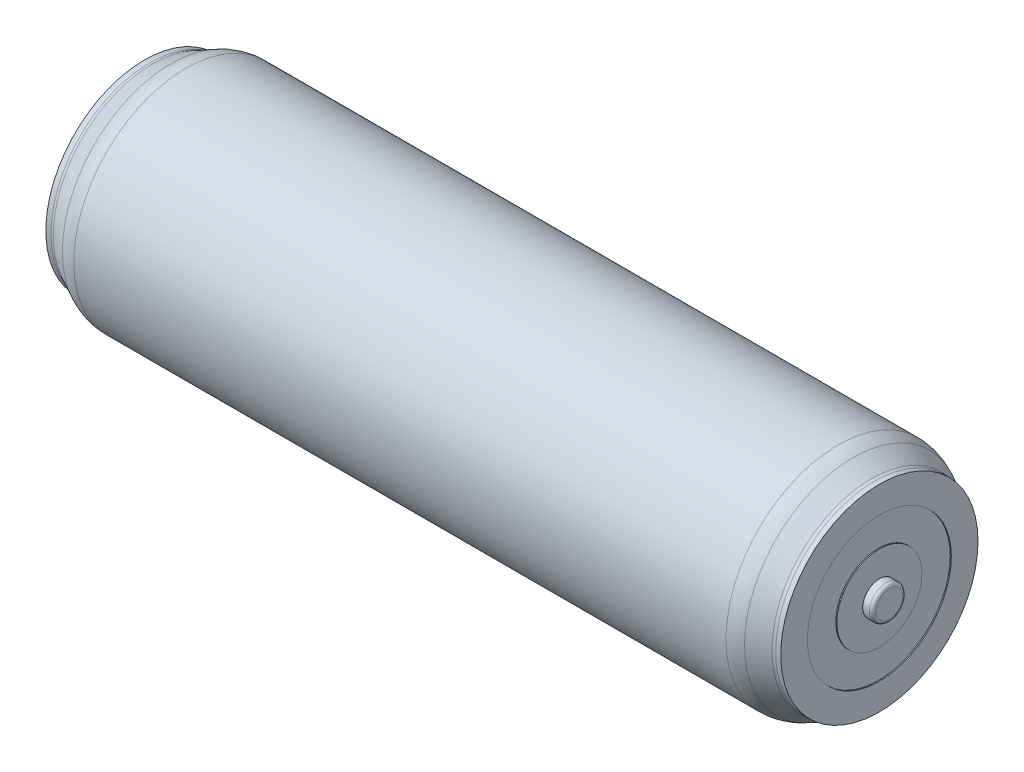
ISO-10303-21;
HEADER;
FILE_DESCRIPTION(('STEP AP214'),'2;1');
FILE_NAME('part.step','',(''),(''),'','','');
FILE_SCHEMA(('AUTOMOTIVE_DESIGN { 1 0 10303 214 1 1 1 1 }'));
ENDSEC;
DATA;
#1=APPLICATION_CONTEXT('core data for automotive mechanical design processes');
#2=APPLICATION_PROTOCOL_DEFINITION('international standard','automotive_design',2000,#1);
#3=PRODUCT_CONTEXT('',#1,'mechanical');
#4=PRODUCT('Part','Part','',(#3));
#5=PRODUCT_RELATED_PRODUCT_CATEGORY('part','',(#4));
#6=PRODUCT_DEFINITION_FORMATION('','',#4);
#7=PRODUCT_DEFINITION_CONTEXT('part definition',#1,'design');
#8=PRODUCT_DEFINITION('design','',#6,#7);
#9=PRODUCT_DEFINITION_SHAPE('','',#8);
#10=(LENGTH_UNIT() NAMED_UNIT(*) SI_UNIT(.MILLI.,.METRE.));
#11=(NAMED_UNIT(*) PLANE_ANGLE_UNIT() SI_UNIT($,.RADIAN.));
#12=(NAMED_UNIT(*) SI_UNIT($,.STERADIAN.) SOLID_ANGLE_UNIT());
#13=UNCERTAINTY_MEASURE_WITH_UNIT(LENGTH_MEASURE(1.E-05),#10,'distance_accuracy_value','');
#14=(GEOMETRIC_REPRESENTATION_CONTEXT(3) GLOBAL_UNCERTAINTY_ASSIGNED_CONTEXT((#13)) GLOBAL_UNIT_ASSIGNED_CONTEXT((#10,
#11,#12)) REPRESENTATION_CONTEXT('',''));
#15=CARTESIAN_POINT('',(0.,0.,0.));
#16=DIRECTION('',(0.,0.,1.));
#17=DIRECTION('',(1.,0.,0.));
#18=AXIS2_PLACEMENT_3D('',#15,#16,#17);
#19=CARTESIAN_POINT('',(0.,0.,0.));
#20=DIRECTION('',(-1.,0.,0.));
#21=DIRECTION('',(0.,0.,1.));
#22=AXIS2_PLACEMENT_3D('',#19,#20,#21);
#23=PLANE('',#22);
#24=CARTESIAN_POINT('',(0.,0.,0.));
#25=DIRECTION('',(1.,0.,0.));
#26=DIRECTION('',(0.,0.,-1.));
#27=AXIS2_PLACEMENT_3D('',#24,#25,#26);
#28=CIRCLE('',#27,2.5);
#29=CARTESIAN_POINT('',(0.,0.,-2.5));
#30=VERTEX_POINT('',#29);
#31=EDGE_CURVE('E113',#30,#30,#28,.T.);
#32=ORIENTED_EDGE('',*,*,#31,.F.);
#33=EDGE_LOOP('',(#32));
#34=FACE_BOUND('',#33,.T.);
#35=ADVANCED_FACE('F34',(#34),#23,.T.);
#36=CARTESIAN_POINT('',(111.4,0.,0.));
#37=DIRECTION('',(1.,0.,0.));
#38=DIRECTION('',(0.,0.,-1.));
#39=AXIS2_PLACEMENT_3D('',#36,#37,#38);
#40=PLANE('',#39);
#41=CARTESIAN_POINT('',(111.4,0.,0.));
#42=DIRECTION('',(1.,0.,0.));
#43=DIRECTION('',(0.,0.,-1.));
#44=AXIS2_PLACEMENT_3D('',#41,#42,#43);
#45=CIRCLE('',#44,2.);
#46=CARTESIAN_POINT('',(111.4,0.,-2.));
#47=VERTEX_POINT('',#46);
#48=EDGE_CURVE('E10',#47,#47,#45,.T.);
#49=ORIENTED_EDGE('',*,*,#48,.T.);
#50=EDGE_LOOP('',(#49));
#51=FACE_BOUND('',#50,.T.);
#52=ADVANCED_FACE('F121',(#51),#40,.T.);
#53=CARTESIAN_POINT('',(110.9,0.,0.));
#54=DIRECTION('',(1.,0.,0.));
#55=DIRECTION('',(0.,0.,-1.));
#56=AXIS2_PLACEMENT_3D('',#53,#54,#55);
#57=TOROIDAL_SURFACE('',#56,2.,0.5);
#58=CARTESIAN_POINT('',(110.9,0.,0.));
#59=DIRECTION('',(1.,0.,0.));
#60=DIRECTION('',(0.,0.,-1.));
#61=AXIS2_PLACEMENT_3D('',#58,#59,#60);
#62=CIRCLE('',#61,2.5);
#63=CARTESIAN_POINT('',(110.9,0.,-2.5));
#64=VERTEX_POINT('',#63);
#65=EDGE_CURVE('E40',#64,#64,#62,.T.);
#66=ORIENTED_EDGE('',*,*,#65,.T.);
#67=EDGE_LOOP('',(#66));
#68=FACE_BOUND('',#67,.T.);
#69=ORIENTED_EDGE('',*,*,#48,.F.);
#70=EDGE_LOOP('',(#69));
#71=FACE_BOUND('',#70,.T.);
#72=ADVANCED_FACE('F125',(#68,#71),#57,.T.);
#73=CARTESIAN_POINT('',(124.515909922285,0.,0.));
#74=DIRECTION('',(1.,0.,0.));
#75=DIRECTION('',(0.,0.,-1.));
#76=AXIS2_PLACEMENT_3D('',#73,#74,#75);
#77=CYLINDRICAL_SURFACE('',#76,2.5);
#78=CARTESIAN_POINT('',(109.9,0.,0.));
#79=DIRECTION('',(1.,0.,0.));
#80=DIRECTION('',(0.,0.,-1.));
#81=AXIS2_PLACEMENT_3D('',#78,#79,#80);
#82=CIRCLE('',#81,2.5);
#83=CARTESIAN_POINT('',(109.9,0.,-2.5));
#84=VERTEX_POINT('',#83);
#85=EDGE_CURVE('E44',#84,#84,#82,.T.);
#86=ORIENTED_EDGE('',*,*,#85,.T.);
#87=EDGE_LOOP('',(#86));
#88=FACE_BOUND('',#87,.T.);
#89=ORIENTED_EDGE('',*,*,#65,.F.);
#90=EDGE_LOOP('',(#89));
#91=FACE_BOUND('',#90,.T.);
#92=ADVANCED_FACE('F129',(#88,#91),#77,.T.);
#93=CARTESIAN_POINT('',(109.9,-2.5,0.));
#94=DIRECTION('',(1.,0.,0.));
#95=DIRECTION('',(0.,0.,-1.));
#96=AXIS2_PLACEMENT_3D('',#93,#94,#95);
#97=PLANE('',#96);
#98=CARTESIAN_POINT('',(109.9,0.,0.));
#99=DIRECTION('',(1.,0.,0.));
#100=DIRECTION('',(0.,0.,-1.));
#101=AXIS2_PLACEMENT_3D('',#98,#99,#100);
#102=CIRCLE('',#101,6.35759511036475);
#103=CARTESIAN_POINT('',(109.9,0.,-6.35759511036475));
#104=VERTEX_POINT('',#103);
#105=EDGE_CURVE('E48',#104,#104,#102,.T.);
#106=ORIENTED_EDGE('',*,*,#105,.T.);
#107=EDGE_LOOP('',(#106));
#108=FACE_BOUND('',#107,.T.);
#109=ORIENTED_EDGE('',*,*,#85,.F.);
#110=EDGE_LOOP('',(#109));
#111=FACE_BOUND('',#110,.T.);
#112=ADVANCED_FACE('F134',(#108,#111),#97,.T.);
#113=CARTESIAN_POINT('',(124.515909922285,0.,0.));
#114=DIRECTION('',(1.,0.,0.));
#115=DIRECTION('',(0.,0.,-1.));
#116=AXIS2_PLACEMENT_3D('',#113,#114,#115);
#117=CYLINDRICAL_SURFACE('',#116,6.35759511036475);
#118=CARTESIAN_POINT('',(109.746341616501,0.,0.));
#119=DIRECTION('',(1.,0.,0.));
#120=DIRECTION('',(0.,0.,-1.));
#121=AXIS2_PLACEMENT_3D('',#118,#119,#120);
#122=CIRCLE('',#121,6.35759511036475);
#123=CARTESIAN_POINT('',(109.746341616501,0.,-6.35759511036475));
#124=VERTEX_POINT('',#123);
#125=EDGE_CURVE('E53',#124,#124,#122,.T.);
#126=ORIENTED_EDGE('',*,*,#125,.T.);
#127=EDGE_LOOP('',(#126));
#128=FACE_BOUND('',#127,.T.);
#129=ORIENTED_EDGE('',*,*,#105,.F.);
#130=EDGE_LOOP('',(#129));
#131=FACE_BOUND('',#130,.T.);
#132=ADVANCED_FACE('F138',(#128,#131),#117,.T.);
#133=CARTESIAN_POINT('',(109.746341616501,-10.760927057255,0.));
#134=DIRECTION('',(1.,0.,0.));
#135=DIRECTION('',(0.,0.,-1.));
#136=AXIS2_PLACEMENT_3D('',#133,#134,#135);
#137=PLANE('',#136);
#138=CARTESIAN_POINT('',(109.746341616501,0.,0.));
#139=DIRECTION('',(1.,0.,0.));
#140=DIRECTION('',(0.,0.,-1.));
#141=AXIS2_PLACEMENT_3D('',#138,#139,#140);
#142=CIRCLE('',#141,10.760927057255);
#143=CARTESIAN_POINT('',(109.746341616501,0.,-10.760927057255));
#144=VERTEX_POINT('',#143);
#145=EDGE_CURVE('E56',#144,#144,#142,.T.);
#146=ORIENTED_EDGE('',*,*,#145,.T.);
#147=EDGE_LOOP('',(#146));
#148=FACE_BOUND('',#147,.T.);
#149=ORIENTED_EDGE('',*,*,#125,.F.);
#150=EDGE_LOOP('',(#149));
#151=FACE_BOUND('',#150,.T.);
#152=ADVANCED_FACE('F142',(#148,#151),#137,.T.);
#153=CARTESIAN_POINT('',(124.515909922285,0.,0.));
#154=DIRECTION('',(1.,0.,0.));
#155=DIRECTION('',(0.,0.,-1.));
#156=AXIS2_PLACEMENT_3D('',#153,#154,#155);
#157=CYLINDRICAL_SURFACE('',#156,10.760927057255);
#158=CARTESIAN_POINT('',(109.9,0.,0.));
#159=DIRECTION('',(1.,0.,0.));
#160=DIRECTION('',(0.,0.,-1.));
#161=AXIS2_PLACEMENT_3D('',#158,#159,#160);
#162=CIRCLE('',#161,10.760927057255);
#163=CARTESIAN_POINT('',(109.9,0.,-10.760927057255));
#164=VERTEX_POINT('',#163);
#165=EDGE_CURVE('E59',#164,#164,#162,.T.);
#166=ORIENTED_EDGE('',*,*,#165,.T.);
#167=EDGE_LOOP('',(#166));
#168=FACE_BOUND('',#167,.T.);
#169=ORIENTED_EDGE('',*,*,#145,.F.);
#170=EDGE_LOOP('',(#169));
#171=FACE_BOUND('',#170,.T.);
#172=ADVANCED_FACE('F146',(#168,#171),#157,.F.);
#173=CARTESIAN_POINT('',(109.9,-10.760927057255,0.));
#174=DIRECTION('',(1.,0.,0.));
#175=DIRECTION('',(0.,0.,-1.));
#176=AXIS2_PLACEMENT_3D('',#173,#174,#175);
#177=PLANE('',#176);
#178=CARTESIAN_POINT('',(109.9,0.,0.));
#179=DIRECTION('',(1.,0.,0.));
#180=DIRECTION('',(0.,0.,-1.));
#181=AXIS2_PLACEMENT_3D('',#178,#179,#180);
#182=CIRCLE('',#181,14.75);
#183=CARTESIAN_POINT('',(109.9,0.,-14.75));
#184=VERTEX_POINT('',#183);
#185=EDGE_CURVE('E62',#184,#184,#182,.T.);
#186=ORIENTED_EDGE('',*,*,#185,.T.);
#187=EDGE_LOOP('',(#186));
#188=FACE_BOUND('',#187,.T.);
#189=ORIENTED_EDGE('',*,*,#165,.F.);
#190=EDGE_LOOP('',(#189));
#191=FACE_BOUND('',#190,.T.);
#192=ADVANCED_FACE('F150',(#188,#191),#177,.T.);
#193=CARTESIAN_POINT('',(124.515909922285,0.,0.));
#194=DIRECTION('',(1.,0.,0.));
#195=DIRECTION('',(0.,0.,-1.));
#196=AXIS2_PLACEMENT_3D('',#193,#194,#195);
#197=CYLINDRICAL_SURFACE('',#196,14.75);
#198=CARTESIAN_POINT('',(109.1360679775,0.,0.));
#199=DIRECTION('',(1.,0.,0.));
#200=DIRECTION('',(0.,0.,-1.));
#201=AXIS2_PLACEMENT_3D('',#198,#199,#200);
#202=CIRCLE('',#201,14.75);
#203=CARTESIAN_POINT('',(109.1360679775,0.,-14.75));
#204=VERTEX_POINT('',#203);
#205=EDGE_CURVE('E65',#204,#204,#202,.T.);
#206=ORIENTED_EDGE('',*,*,#205,.T.);
#207=EDGE_LOOP('',(#206));
#208=FACE_BOUND('',#207,.T.);
#209=ORIENTED_EDGE('',*,*,#185,.F.);
#210=EDGE_LOOP('',(#209));
#211=FACE_BOUND('',#210,.T.);
#212=ADVANCED_FACE('F154',(#208,#211),#197,.T.);
#213=CARTESIAN_POINT('',(109.1360679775,0.,0.));
#214=DIRECTION('',(1.,0.,0.));
#215=DIRECTION('',(0.,0.,-1.));
#216=AXIS2_PLACEMENT_3D('',#213,#214,#215);
#217=TOROIDAL_SURFACE('',#216,15.75,1.);
#218=CARTESIAN_POINT('',(108.688854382,0.,0.));
#219=DIRECTION('',(1.,0.,0.));
#220=DIRECTION('',(0.,0.,-1.));
#221=AXIS2_PLACEMENT_3D('',#218,#219,#220);
#222=CIRCLE('',#221,14.8555728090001);
#223=CARTESIAN_POINT('',(108.688854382,0.,-14.8555728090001));
#224=VERTEX_POINT('',#223);
#225=EDGE_CURVE('E68',#224,#224,#222,.T.);
#226=ORIENTED_EDGE('',*,*,#225,.T.);
#227=EDGE_LOOP('',(#226));
#228=FACE_BOUND('',#227,.T.);
#229=ORIENTED_EDGE('',*,*,#205,.F.);
#230=EDGE_LOOP('',(#229));
#231=FACE_BOUND('',#230,.T.);
#232=ADVANCED_FACE('F158',(#228,#231),#217,.F.);
#233=CARTESIAN_POINT('',(108.688854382,0.,0.));
#234=DIRECTION('',(-1.,0.,0.));
#235=DIRECTION('',(0.,0.,1.));
#236=AXIS2_PLACEMENT_3D('',#233,#234,#235);
#237=CONICAL_SURFACE('',#236,14.8555728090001,0.463647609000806);
#238=CARTESIAN_POINT('',(105.955728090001,0.,0.));
#239=DIRECTION('',(1.,0.,0.));
#240=DIRECTION('',(0.,0.,-1.));
#241=AXIS2_PLACEMENT_3D('',#238,#239,#240);
#242=CIRCLE('',#241,16.2221359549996);
#243=CARTESIAN_POINT('',(105.955728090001,0.,-16.2221359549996));
#244=VERTEX_POINT('',#243);
#245=EDGE_CURVE('E71',#244,#244,#242,.T.);
#246=ORIENTED_EDGE('',*,*,#245,.T.);
#247=EDGE_LOOP('',(#246));
#248=FACE_BOUND('',#247,.T.);
#249=ORIENTED_EDGE('',*,*,#225,.F.);
#250=EDGE_LOOP('',(#249));
#251=FACE_BOUND('',#250,.T.);
#252=ADVANCED_FACE('F162',(#248,#251),#237,.T.);
#253=CARTESIAN_POINT('',(103.719660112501,0.,0.));
#254=DIRECTION('',(1.,0.,0.));
#255=DIRECTION('',(0.,0.,-1.));
#256=AXIS2_PLACEMENT_3D('',#253,#254,#255);
#257=TOROIDAL_SURFACE('',#256,11.75,5.);
#258=CARTESIAN_POINT('',(103.719660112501,0.,0.));
#259=DIRECTION('',(1.,0.,0.));
#260=DIRECTION('',(0.,0.,-1.));
#261=AXIS2_PLACEMENT_3D('',#258,#259,#260);
#262=CIRCLE('',#261,16.75);
#263=CARTESIAN_POINT('',(103.719660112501,0.,-16.75));
#264=VERTEX_POINT('',#263);
#265=EDGE_CURVE('E74',#264,#264,#262,.T.);
#266=ORIENTED_EDGE('',*,*,#265,.T.);
#267=EDGE_LOOP('',(#266));
#268=FACE_BOUND('',#267,.T.);
#269=ORIENTED_EDGE('',*,*,#245,.F.);
#270=EDGE_LOOP('',(#269));
#271=FACE_BOUND('',#270,.T.);
#272=ADVANCED_FACE('F166',(#268,#271),#257,.T.);
#273=CARTESIAN_POINT('',(124.515909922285,0.,0.));
#274=DIRECTION('',(1.,0.,0.));
#275=DIRECTION('',(0.,0.,-1.));
#276=AXIS2_PLACEMENT_3D('',#273,#274,#275);
#277=CYLINDRICAL_SURFACE('',#276,16.75);
#278=CARTESIAN_POINT('',(6.18033988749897,0.,0.));
#279=DIRECTION('',(1.,0.,0.));
#280=DIRECTION('',(0.,0.,-1.));
#281=AXIS2_PLACEMENT_3D('',#278,#279,#280);
#282=CIRCLE('',#281,16.75);
#283=CARTESIAN_POINT('',(6.18033988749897,0.,-16.75));
#284=VERTEX_POINT('',#283);
#285=EDGE_CURVE('E77',#284,#284,#282,.T.);
#286=ORIENTED_EDGE('',*,*,#285,.T.);
#287=EDGE_LOOP('',(#286));
#288=FACE_BOUND('',#287,.T.);
#289=ORIENTED_EDGE('',*,*,#265,.F.);
#290=EDGE_LOOP('',(#289));
#291=FACE_BOUND('',#290,.T.);
#292=ADVANCED_FACE('F170',(#288,#291),#277,.T.);
#293=CARTESIAN_POINT('',(6.18033988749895,0.,0.));
#294=DIRECTION('',(1.,0.,0.));
#295=DIRECTION('',(0.,0.,-1.));
#296=AXIS2_PLACEMENT_3D('',#293,#294,#295);
#297=TOROIDAL_SURFACE('',#296,11.75,5.);
#298=CARTESIAN_POINT('',(3.94427190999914,0.,0.));
#299=DIRECTION('',(1.,0.,0.));
#300=DIRECTION('',(0.,0.,-1.));
#301=AXIS2_PLACEMENT_3D('',#298,#299,#300);
#302=CIRCLE('',#301,16.2221359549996);
#303=CARTESIAN_POINT('',(3.94427190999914,0.,-16.2221359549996));
#304=VERTEX_POINT('',#303);
#305=EDGE_CURVE('E80',#304,#304,#302,.T.);
#306=ORIENTED_EDGE('',*,*,#305,.T.);
#307=EDGE_LOOP('',(#306));
#308=FACE_BOUND('',#307,.T.);
#309=ORIENTED_EDGE('',*,*,#285,.F.);
#310=EDGE_LOOP('',(#309));
#311=FACE_BOUND('',#310,.T.);
#312=ADVANCED_FACE('F174',(#308,#311),#297,.T.);
#313=CARTESIAN_POINT('',(3.94427190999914,0.,0.));
#314=DIRECTION('',(1.,0.,0.));
#315=DIRECTION('',(0.,0.,-1.));
#316=AXIS2_PLACEMENT_3D('',#313,#314,#315);
#317=CONICAL_SURFACE('',#316,16.2221359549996,0.463647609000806);
#318=CARTESIAN_POINT('',(1.21114561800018,0.,0.));
#319=DIRECTION('',(1.,0.,0.));
#320=DIRECTION('',(0.,0.,-1.));
#321=AXIS2_PLACEMENT_3D('',#318,#319,#320);
#322=CIRCLE('',#321,14.8555728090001);
#323=CARTESIAN_POINT('',(1.21114561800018,0.,-14.8555728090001));
#324=VERTEX_POINT('',#323);
#325=EDGE_CURVE('E83',#324,#324,#322,.T.);
#326=ORIENTED_EDGE('',*,*,#325,.T.);
#327=EDGE_LOOP('',(#326));
#328=FACE_BOUND('',#327,.T.);
#329=ORIENTED_EDGE('',*,*,#305,.F.);
#330=EDGE_LOOP('',(#329));
#331=FACE_BOUND('',#330,.T.);
#332=ADVANCED_FACE('F178',(#328,#331),#317,.T.);
#333=CARTESIAN_POINT('',(0.763932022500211,0.,0.));
#334=DIRECTION('',(1.,0.,0.));
#335=DIRECTION('',(0.,0.,-1.));
#336=AXIS2_PLACEMENT_3D('',#333,#334,#335);
#337=TOROIDAL_SURFACE('',#336,15.75,0.999999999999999);
#338=CARTESIAN_POINT('',(0.763932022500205,0.,0.));
#339=DIRECTION('',(1.,0.,0.));
#340=DIRECTION('',(0.,0.,-1.));
#341=AXIS2_PLACEMENT_3D('',#338,#339,#340);
#342=CIRCLE('',#341,14.75);
#343=CARTESIAN_POINT('',(0.763932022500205,0.,-14.75));
#344=VERTEX_POINT('',#343);
#345=EDGE_CURVE('E86',#344,#344,#342,.T.);
#346=ORIENTED_EDGE('',*,*,#345,.T.);
#347=EDGE_LOOP('',(#346));
#348=FACE_BOUND('',#347,.T.);
#349=ORIENTED_EDGE('',*,*,#325,.F.);
#350=EDGE_LOOP('',(#349));
#351=FACE_BOUND('',#350,.T.);
#352=ADVANCED_FACE('F182',(#348,#351),#337,.F.);
#353=CARTESIAN_POINT('',(124.515909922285,0.,0.));
#354=DIRECTION('',(1.,0.,0.));
#355=DIRECTION('',(0.,0.,-1.));
#356=AXIS2_PLACEMENT_3D('',#353,#354,#355);
#357=CYLINDRICAL_SURFACE('',#356,14.75);
#358=CARTESIAN_POINT('',(0.,0.,0.));
#359=DIRECTION('',(1.,0.,0.));
#360=DIRECTION('',(0.,0.,-1.));
#361=AXIS2_PLACEMENT_3D('',#358,#359,#360);
#362=CIRCLE('',#361,14.75);
#363=CARTESIAN_POINT('',(0.,0.,-14.75));
#364=VERTEX_POINT('',#363);
#365=EDGE_CURVE('E89',#364,#364,#362,.T.);
#366=ORIENTED_EDGE('',*,*,#365,.T.);
#367=EDGE_LOOP('',(#366));
#368=FACE_BOUND('',#367,.T.);
#369=ORIENTED_EDGE('',*,*,#345,.F.);
#370=EDGE_LOOP('',(#369));
#371=FACE_BOUND('',#370,.T.);
#372=ADVANCED_FACE('F186',(#368,#371),#357,.T.);
#373=CARTESIAN_POINT('',(0.,-10.760927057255,0.));
#374=DIRECTION('',(-1.,0.,0.));
#375=DIRECTION('',(0.,0.,1.));
#376=AXIS2_PLACEMENT_3D('',#373,#374,#375);
#377=PLANE('',#376);
#378=CARTESIAN_POINT('',(0.,0.,0.));
#379=DIRECTION('',(1.,0.,0.));
#380=DIRECTION('',(0.,0.,-1.));
#381=AXIS2_PLACEMENT_3D('',#378,#379,#380);
#382=CIRCLE('',#381,10.760927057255);
#383=CARTESIAN_POINT('',(0.,0.,-10.760927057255));
#384=VERTEX_POINT('',#383);
#385=EDGE_CURVE('E92',#384,#384,#382,.T.);
#386=ORIENTED_EDGE('',*,*,#385,.T.);
#387=EDGE_LOOP('',(#386));
#388=FACE_BOUND('',#387,.T.);
#389=ORIENTED_EDGE('',*,*,#365,.F.);
#390=EDGE_LOOP('',(#389));
#391=FACE_BOUND('',#390,.T.);
#392=ADVANCED_FACE('F190',(#388,#391),#377,.T.);
#393=CARTESIAN_POINT('',(124.515909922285,0.,0.));
#394=DIRECTION('',(1.,0.,0.));
#395=DIRECTION('',(0.,0.,-1.));
#396=AXIS2_PLACEMENT_3D('',#393,#394,#395);
#397=CYLINDRICAL_SURFACE('',#396,10.760927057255);
#398=CARTESIAN_POINT('',(0.144359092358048,0.,0.));
#399=DIRECTION('',(1.,0.,0.));
#400=DIRECTION('',(0.,0.,-1.));
#401=AXIS2_PLACEMENT_3D('',#398,#399,#400);
#402=CIRCLE('',#401,10.760927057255);
#403=CARTESIAN_POINT('',(0.144359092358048,0.,-10.760927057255));
#404=VERTEX_POINT('',#403);
#405=EDGE_CURVE('E95',#404,#404,#402,.T.);
#406=ORIENTED_EDGE('',*,*,#405,.T.);
#407=EDGE_LOOP('',(#406));
#408=FACE_BOUND('',#407,.T.);
#409=ORIENTED_EDGE('',*,*,#385,.F.);
#410=EDGE_LOOP('',(#409));
#411=FACE_BOUND('',#410,.T.);
#412=ADVANCED_FACE('F194',(#408,#411),#397,.F.);
#413=CARTESIAN_POINT('',(0.144359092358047,-10.760927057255,0.));
#414=DIRECTION('',(-1.,0.,0.));
#415=DIRECTION('',(0.,0.,1.));
#416=AXIS2_PLACEMENT_3D('',#413,#414,#415);
#417=PLANE('',#416);
#418=CARTESIAN_POINT('',(0.144359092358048,0.,0.));
#419=DIRECTION('',(1.,0.,0.));
#420=DIRECTION('',(0.,0.,-1.));
#421=AXIS2_PLACEMENT_3D('',#418,#419,#420);
#422=CIRCLE('',#421,6.35759511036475);
#423=CARTESIAN_POINT('',(0.144359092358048,0.,-6.35759511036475));
#424=VERTEX_POINT('',#423);
#425=EDGE_CURVE('E98',#424,#424,#422,.T.);
#426=ORIENTED_EDGE('',*,*,#425,.T.);
#427=EDGE_LOOP('',(#426));
#428=FACE_BOUND('',#427,.T.);
#429=ORIENTED_EDGE('',*,*,#405,.F.);
#430=EDGE_LOOP('',(#429));
#431=FACE_BOUND('',#430,.T.);
#432=ADVANCED_FACE('F198',(#428,#431),#417,.T.);
#433=CARTESIAN_POINT('',(124.515909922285,0.,0.));
#434=DIRECTION('',(1.,0.,0.));
#435=DIRECTION('',(0.,0.,-1.));
#436=AXIS2_PLACEMENT_3D('',#433,#434,#435);
#437=CYLINDRICAL_SURFACE('',#436,6.35759511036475);
#438=CARTESIAN_POINT('',(0.,0.,0.));
#439=DIRECTION('',(1.,0.,0.));
#440=DIRECTION('',(0.,0.,-1.));
#441=AXIS2_PLACEMENT_3D('',#438,#439,#440);
#442=CIRCLE('',#441,6.35759511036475);
#443=CARTESIAN_POINT('',(0.,0.,-6.35759511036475));
#444=VERTEX_POINT('',#443);
#445=EDGE_CURVE('E101',#444,#444,#442,.T.);
#446=ORIENTED_EDGE('',*,*,#445,.T.);
#447=EDGE_LOOP('',(#446));
#448=FACE_BOUND('',#447,.T.);
#449=ORIENTED_EDGE('',*,*,#425,.F.);
#450=EDGE_LOOP('',(#449));
#451=FACE_BOUND('',#450,.T.);
#452=ADVANCED_FACE('F202',(#448,#451),#437,.T.);
#453=CARTESIAN_POINT('',(0.,-4.45165445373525,0.));
#454=DIRECTION('',(-1.,0.,0.));
#455=DIRECTION('',(0.,0.,1.));
#456=AXIS2_PLACEMENT_3D('',#453,#454,#455);
#457=PLANE('',#456);
#458=CARTESIAN_POINT('',(0.,0.,0.));
#459=DIRECTION('',(1.,0.,0.));
#460=DIRECTION('',(0.,0.,-1.));
#461=AXIS2_PLACEMENT_3D('',#458,#459,#460);
#462=CIRCLE('',#461,4.45165445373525);
#463=CARTESIAN_POINT('',(0.,0.,-4.45165445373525));
#464=VERTEX_POINT('',#463);
#465=EDGE_CURVE('E104',#464,#464,#462,.T.);
#466=ORIENTED_EDGE('',*,*,#465,.T.);
#467=EDGE_LOOP('',(#466));
#468=FACE_BOUND('',#467,.T.);
#469=ORIENTED_EDGE('',*,*,#445,.F.);
#470=EDGE_LOOP('',(#469));
#471=FACE_BOUND('',#470,.T.);
#472=ADVANCED_FACE('F206',(#468,#471),#457,.T.);
#473=CARTESIAN_POINT('',(124.515909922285,0.,0.));
#474=DIRECTION('',(1.,0.,0.));
#475=DIRECTION('',(0.,0.,-1.));
#476=AXIS2_PLACEMENT_3D('',#473,#474,#475);
#477=CYLINDRICAL_SURFACE('',#476,4.45165445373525);
#478=CARTESIAN_POINT('',(0.144359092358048,0.,0.));
#479=DIRECTION('',(1.,0.,0.));
#480=DIRECTION('',(0.,0.,-1.));
#481=AXIS2_PLACEMENT_3D('',#478,#479,#480);
#482=CIRCLE('',#481,4.45165445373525);
#483=CARTESIAN_POINT('',(0.144359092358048,0.,-4.45165445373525));
#484=VERTEX_POINT('',#483);
#485=EDGE_CURVE('E107',#484,#484,#482,.T.);
#486=ORIENTED_EDGE('',*,*,#485,.T.);
#487=EDGE_LOOP('',(#486));
#488=FACE_BOUND('',#487,.T.);
#489=ORIENTED_EDGE('',*,*,#465,.F.);
#490=EDGE_LOOP('',(#489));
#491=FACE_BOUND('',#490,.T.);
#492=ADVANCED_FACE('F210',(#488,#491),#477,.F.);
#493=CARTESIAN_POINT('',(0.144359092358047,-2.5,0.));
#494=DIRECTION('',(-1.,0.,0.));
#495=DIRECTION('',(0.,0.,1.));
#496=AXIS2_PLACEMENT_3D('',#493,#494,#495);
#497=PLANE('',#496);
#498=CARTESIAN_POINT('',(0.144359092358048,0.,0.));
#499=DIRECTION('',(1.,0.,0.));
#500=DIRECTION('',(0.,0.,-1.));
#501=AXIS2_PLACEMENT_3D('',#498,#499,#500);
#502=CIRCLE('',#501,2.5);
#503=CARTESIAN_POINT('',(0.144359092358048,0.,-2.5));
#504=VERTEX_POINT('',#503);
#505=EDGE_CURVE('E110',#504,#504,#502,.T.);
#506=ORIENTED_EDGE('',*,*,#505,.T.);
#507=EDGE_LOOP('',(#506));
#508=FACE_BOUND('',#507,.T.);
#509=ORIENTED_EDGE('',*,*,#485,.F.);
#510=EDGE_LOOP('',(#509));
#511=FACE_BOUND('',#510,.T.);
#512=ADVANCED_FACE('F214',(#508,#511),#497,.T.);
#513=CARTESIAN_POINT('',(124.515909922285,0.,0.));
#514=DIRECTION('',(1.,0.,0.));
#515=DIRECTION('',(0.,0.,-1.));
#516=AXIS2_PLACEMENT_3D('',#513,#514,#515);
#517=CYLINDRICAL_SURFACE('',#516,2.5);
#518=ORIENTED_EDGE('',*,*,#31,.T.);
#519=EDGE_LOOP('',(#518));
#520=FACE_BOUND('',#519,.T.);
#521=ORIENTED_EDGE('',*,*,#505,.F.);
#522=EDGE_LOOP('',(#521));
#523=FACE_BOUND('',#522,.T.);
#524=ADVANCED_FACE('F117',(#520,#523),#517,.T.);
#525=CLOSED_SHELL('',(#35,#52,#72,#92,#112,#132,#152,#172,#192,#212,#232,#252,#272,#292,#312,
#332,#352,#372,#392,#412,#432,#452,#472,#492,#512,#524));
#526=MANIFOLD_SOLID_BREP('B2',#525);
#527=ADVANCED_BREP_SHAPE_REPRESENTATION('',(#18,#526),#14);
#528=SHAPE_DEFINITION_REPRESENTATION(#9,#527);
ENDSEC;
END-ISO-10303-21;
